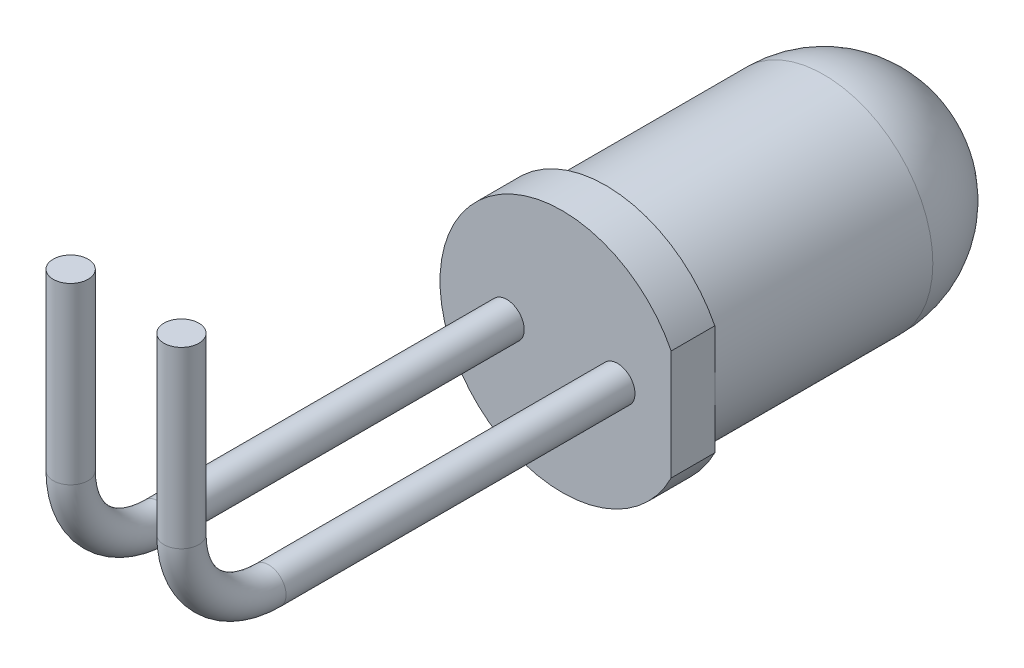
ISO-10303-21;
HEADER;
FILE_DESCRIPTION(('STEP AP214'),'2;1');
FILE_NAME('part.step','',(''),(''),'','','');
FILE_SCHEMA(('AUTOMOTIVE_DESIGN { 1 0 10303 214 1 1 1 1 }'));
ENDSEC;
DATA;
#1=APPLICATION_CONTEXT('core data for automotive mechanical design processes');
#2=APPLICATION_PROTOCOL_DEFINITION('international standard','automotive_design',2000,#1);
#3=PRODUCT_CONTEXT('',#1,'mechanical');
#4=PRODUCT('Part','Part','',(#3));
#5=PRODUCT_RELATED_PRODUCT_CATEGORY('part','',(#4));
#6=PRODUCT_DEFINITION_FORMATION('','',#4);
#7=PRODUCT_DEFINITION_CONTEXT('part definition',#1,'design');
#8=PRODUCT_DEFINITION('design','',#6,#7);
#9=PRODUCT_DEFINITION_SHAPE('','',#8);
#10=(LENGTH_UNIT() NAMED_UNIT(*) SI_UNIT(.MILLI.,.METRE.));
#11=(NAMED_UNIT(*) PLANE_ANGLE_UNIT() SI_UNIT($,.RADIAN.));
#12=(NAMED_UNIT(*) SI_UNIT($,.STERADIAN.) SOLID_ANGLE_UNIT());
#13=UNCERTAINTY_MEASURE_WITH_UNIT(LENGTH_MEASURE(1.E-05),#10,'distance_accuracy_value','');
#14=(GEOMETRIC_REPRESENTATION_CONTEXT(3) GLOBAL_UNCERTAINTY_ASSIGNED_CONTEXT((#13)) GLOBAL_UNIT_ASSIGNED_CONTEXT((#10,
#11,#12)) REPRESENTATION_CONTEXT('',''));
#15=CARTESIAN_POINT('',(0.,0.,0.));
#16=DIRECTION('',(0.,0.,1.));
#17=DIRECTION('',(1.,0.,0.));
#18=AXIS2_PLACEMENT_3D('',#15,#16,#17);
#19=CARTESIAN_POINT('',(0.,0.,8.5));
#20=DIRECTION('',(0.,0.,1.));
#21=DIRECTION('',(1.,0.,0.));
#22=AXIS2_PLACEMENT_3D('',#19,#20,#21);
#23=PLANE('',#22);
#24=CARTESIAN_POINT('',(-1.27,0.,8.5));
#25=DIRECTION('',(0.,0.,1.));
#26=DIRECTION('',(1.,0.,0.));
#27=AXIS2_PLACEMENT_3D('',#24,#25,#26);
#28=CIRCLE('',#27,0.4);
#29=CARTESIAN_POINT('',(-0.87,0.,8.5));
#30=VERTEX_POINT('',#29);
#31=EDGE_CURVE('E11',#30,#30,#28,.T.);
#32=ORIENTED_EDGE('',*,*,#31,.F.);
#33=EDGE_LOOP('',(#32));
#34=FACE_BOUND('',#33,.T.);
#35=DIRECTION('',(0.,1.,0.));
#36=VECTOR('',#35,1.);
#37=CARTESIAN_POINT('',(2.5,1.26095202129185,8.5));
#38=LINE('',#37,#36);
#39=CARTESIAN_POINT('',(2.5,-1.26095202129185,8.5));
#40=VERTEX_POINT('',#39);
#41=CARTESIAN_POINT('',(2.5,1.26095202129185,8.5));
#42=VERTEX_POINT('',#41);
#43=EDGE_CURVE('E79',#40,#42,#38,.T.);
#44=ORIENTED_EDGE('',*,*,#43,.T.);
#45=CARTESIAN_POINT('',(0.,0.,8.5));
#46=DIRECTION('',(0.,0.,1.));
#47=DIRECTION('',(1.,0.,0.));
#48=AXIS2_PLACEMENT_3D('',#45,#46,#47);
#49=CIRCLE('',#48,2.8);
#50=EDGE_CURVE('E69',#42,#40,#49,.T.);
#51=ORIENTED_EDGE('',*,*,#50,.T.);
#52=EDGE_LOOP('',(#44,#51));
#53=FACE_BOUND('',#52,.T.);
#54=CARTESIAN_POINT('',(1.27,0.,8.5));
#55=DIRECTION('',(0.,0.,1.));
#56=DIRECTION('',(1.,0.,0.));
#57=AXIS2_PLACEMENT_3D('',#54,#55,#56);
#58=CIRCLE('',#57,0.4);
#59=CARTESIAN_POINT('',(1.67,0.,8.5));
#60=VERTEX_POINT('',#59);
#61=EDGE_CURVE('E225',#60,#60,#58,.T.);
#62=ORIENTED_EDGE('',*,*,#61,.F.);
#63=EDGE_LOOP('',(#62));
#64=FACE_BOUND('',#63,.T.);
#65=ADVANCED_FACE('F33',(#34,#53,#64),#23,.T.);
#66=CARTESIAN_POINT('',(0.,0.,8.5));
#67=DIRECTION('',(0.,0.,-1.));
#68=DIRECTION('',(-1.,0.,0.));
#69=AXIS2_PLACEMENT_3D('',#66,#67,#68);
#70=CYLINDRICAL_SURFACE('',#69,2.5);
#71=CARTESIAN_POINT('',(0.,0.,2.5));
#72=DIRECTION('',(0.,0.,-1.));
#73=DIRECTION('',(-1.,0.,0.));
#74=AXIS2_PLACEMENT_3D('',#71,#72,#73);
#75=CIRCLE('',#74,2.5);
#76=CARTESIAN_POINT('',(-2.5,0.,2.5));
#77=VERTEX_POINT('',#76);
#78=EDGE_CURVE('E41',#77,#77,#75,.F.);
#79=ORIENTED_EDGE('',*,*,#78,.T.);
#80=EDGE_LOOP('',(#79));
#81=FACE_BOUND('',#80,.T.);
#82=CARTESIAN_POINT('',(0.,0.,7.5));
#83=DIRECTION('',(0.,0.,1.));
#84=DIRECTION('',(1.,0.,0.));
#85=AXIS2_PLACEMENT_3D('',#82,#83,#84);
#86=CIRCLE('',#85,2.5);
#87=CARTESIAN_POINT('',(2.5,0.,7.5));
#88=VERTEX_POINT('',#87);
#89=EDGE_CURVE('E46',#88,#88,#86,.T.);
#90=ORIENTED_EDGE('',*,*,#89,.F.);
#91=EDGE_LOOP('',(#90));
#92=FACE_BOUND('',#91,.T.);
#93=ADVANCED_FACE('F35',(#81,#92),#70,.T.);
#94=CARTESIAN_POINT('',(0.,0.,7.5));
#95=DIRECTION('',(0.,0.,1.));
#96=DIRECTION('',(1.,0.,0.));
#97=AXIS2_PLACEMENT_3D('',#94,#95,#96);
#98=PLANE('',#97);
#99=DIRECTION('',(0.,1.,0.));
#100=VECTOR('',#99,1.);
#101=CARTESIAN_POINT('',(2.5,1.26095202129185,7.5));
#102=LINE('',#101,#100);
#103=CARTESIAN_POINT('',(2.5,1.26095202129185,7.5));
#104=VERTEX_POINT('',#103);
#105=EDGE_CURVE('E53',#88,#104,#102,.T.);
#106=ORIENTED_EDGE('',*,*,#105,.F.);
#107=ORIENTED_EDGE('',*,*,#89,.T.);
#108=CARTESIAN_POINT('',(2.5,-1.26095202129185,7.5));
#109=VERTEX_POINT('',#108);
#110=EDGE_CURVE('E75',#109,#88,#102,.T.);
#111=ORIENTED_EDGE('',*,*,#110,.F.);
#112=CARTESIAN_POINT('',(0.,0.,7.5));
#113=DIRECTION('',(0.,0.,1.));
#114=DIRECTION('',(1.,0.,0.));
#115=AXIS2_PLACEMENT_3D('',#112,#113,#114);
#116=CIRCLE('',#115,2.8);
#117=EDGE_CURVE('E71',#104,#109,#116,.T.);
#118=ORIENTED_EDGE('',*,*,#117,.F.);
#119=EDGE_LOOP('',(#106,#107,#111,#118));
#120=FACE_BOUND('',#119,.T.);
#121=ADVANCED_FACE('F111',(#120),#98,.F.);
#122=CARTESIAN_POINT('',(2.5,1.26095202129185,7.5));
#123=DIRECTION('',(1.,0.,0.));
#124=DIRECTION('',(0.,0.,-1.));
#125=AXIS2_PLACEMENT_3D('',#122,#123,#124);
#126=PLANE('',#125);
#127=ORIENTED_EDGE('',*,*,#110,.T.);
#128=ORIENTED_EDGE('',*,*,#105,.T.);
#129=DIRECTION('',(0.,0.,1.));
#130=VECTOR('',#129,1.);
#131=CARTESIAN_POINT('',(2.5,1.26095202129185,7.5));
#132=LINE('',#131,#130);
#133=EDGE_CURVE('E74',#104,#42,#132,.T.);
#134=ORIENTED_EDGE('',*,*,#133,.T.);
#135=ORIENTED_EDGE('',*,*,#43,.F.);
#136=DIRECTION('',(0.,0.,1.));
#137=VECTOR('',#136,1.);
#138=CARTESIAN_POINT('',(2.5,-1.26095202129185,7.5));
#139=LINE('',#138,#137);
#140=EDGE_CURVE('E66',#109,#40,#139,.T.);
#141=ORIENTED_EDGE('',*,*,#140,.F.);
#142=EDGE_LOOP('',(#127,#128,#134,#135,#141));
#143=FACE_BOUND('',#142,.T.);
#144=ADVANCED_FACE('F82',(#143),#126,.T.);
#145=CARTESIAN_POINT('',(0.,0.,7.5));
#146=DIRECTION('',(0.,0.,1.));
#147=DIRECTION('',(1.,0.,0.));
#148=AXIS2_PLACEMENT_3D('',#145,#146,#147);
#149=CYLINDRICAL_SURFACE('',#148,2.8);
#150=ORIENTED_EDGE('',*,*,#50,.F.);
#151=ORIENTED_EDGE('',*,*,#133,.F.);
#152=ORIENTED_EDGE('',*,*,#117,.T.);
#153=ORIENTED_EDGE('',*,*,#140,.T.);
#154=EDGE_LOOP('',(#150,#151,#152,#153));
#155=FACE_BOUND('',#154,.T.);
#156=ADVANCED_FACE('F68',(#155),#149,.T.);
#157=CARTESIAN_POINT('',(0.,0.,2.5));
#158=DIRECTION('',(0.,0.,1.));
#159=DIRECTION('',(1.,0.,0.));
#160=AXIS2_PLACEMENT_3D('',#157,#158,#159);
#161=SPHERICAL_SURFACE('',#160,2.5);
#162=ORIENTED_EDGE('',*,*,#78,.F.);
#163=EDGE_LOOP('',(#162));
#164=FACE_BOUND('',#163,.T.);
#165=ADVANCED_FACE('F93',(#164),#161,.T.);
#166=CARTESIAN_POINT('',(1.27,2.00000000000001,18.5));
#167=DIRECTION('',(0.,1.,0.));
#168=DIRECTION('',(0.,0.,1.));
#169=AXIS2_PLACEMENT_3D('',#166,#167,#168);
#170=CYLINDRICAL_SURFACE('',#169,0.4);
#171=CARTESIAN_POINT('',(1.27,2.00000000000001,18.5));
#172=DIRECTION('',(0.,1.,0.));
#173=DIRECTION('',(1.,0.,0.));
#174=AXIS2_PLACEMENT_3D('',#171,#172,#173);
#175=CIRCLE('',#174,0.4);
#176=CARTESIAN_POINT('',(1.27,2.00000000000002,18.9));
#177=VERTEX_POINT('',#176);
#178=EDGE_CURVE('E238',#177,#177,#175,.T.);
#179=ORIENTED_EDGE('',*,*,#178,.T.);
#180=EDGE_LOOP('',(#179));
#181=FACE_BOUND('',#180,.T.);
#182=CARTESIAN_POINT('',(1.27,6.,18.5));
#183=DIRECTION('',(0.,1.,0.));
#184=DIRECTION('',(1.,0.,0.));
#185=AXIS2_PLACEMENT_3D('',#182,#183,#184);
#186=CIRCLE('',#185,0.4);
#187=CARTESIAN_POINT('',(1.67,6.,18.5));
#188=VERTEX_POINT('',#187);
#189=EDGE_CURVE('E80',#188,#188,#186,.T.);
#190=ORIENTED_EDGE('',*,*,#189,.F.);
#191=EDGE_LOOP('',(#190));
#192=FACE_BOUND('',#191,.T.);
#193=ADVANCED_FACE('F95',(#181,#192),#170,.T.);
#194=CARTESIAN_POINT('',(1.27,2.,16.5));
#195=DIRECTION('',(-1.,0.,0.));
#196=DIRECTION('',(0.,0.,1.));
#197=AXIS2_PLACEMENT_3D('',#194,#195,#196);
#198=TOROIDAL_SURFACE('',#197,2.,0.4);
#199=CARTESIAN_POINT('',(1.27,0.,16.5));
#200=DIRECTION('',(0.,0.,1.));
#201=DIRECTION('',(1.,0.,0.));
#202=AXIS2_PLACEMENT_3D('',#199,#200,#201);
#203=CIRCLE('',#202,0.4);
#204=CARTESIAN_POINT('',(1.27,-0.4,16.5));
#205=VERTEX_POINT('',#204);
#206=EDGE_CURVE('E229',#205,#205,#203,.T.);
#207=CARTESIAN_POINT('',(1.27,2.,16.5));
#208=DIRECTION('',(-1.,0.,0.));
#209=DIRECTION('',(0.,0.,1.));
#210=AXIS2_PLACEMENT_3D('',#207,#208,#209);
#211=CIRCLE('',#210,2.4);
#212=EDGE_CURVE('',#205,#177,#211,.T.);
#213=ORIENTED_EDGE('',*,*,#206,.T.);
#214=ORIENTED_EDGE('',*,*,#178,.F.);
#215=ORIENTED_EDGE('',*,*,#212,.T.);
#216=ORIENTED_EDGE('',*,*,#212,.F.);
#217=EDGE_LOOP('',(#213,#215,#214,#216));
#218=FACE_BOUND('',#217,.T.);
#219=ADVANCED_FACE('F101',(#218),#198,.T.);
#220=CARTESIAN_POINT('',(1.27,0.,16.5));
#221=DIRECTION('',(0.,0.,-1.));
#222=DIRECTION('',(-1.,0.,0.));
#223=AXIS2_PLACEMENT_3D('',#220,#221,#222);
#224=CYLINDRICAL_SURFACE('',#223,0.4);
#225=ORIENTED_EDGE('',*,*,#206,.F.);
#226=EDGE_LOOP('',(#225));
#227=FACE_BOUND('',#226,.T.);
#228=ORIENTED_EDGE('',*,*,#61,.T.);
#229=EDGE_LOOP('',(#228));
#230=FACE_BOUND('',#229,.T.);
#231=ADVANCED_FACE('F154',(#227,#230),#224,.T.);
#232=CARTESIAN_POINT('',(1.27,6.,18.5));
#233=DIRECTION('',(0.,1.,0.));
#234=DIRECTION('',(1.,0.,0.));
#235=AXIS2_PLACEMENT_3D('',#232,#233,#234);
#236=PLANE('',#235);
#237=ORIENTED_EDGE('',*,*,#189,.T.);
#238=EDGE_LOOP('',(#237));
#239=FACE_BOUND('',#238,.T.);
#240=ADVANCED_FACE('F164',(#239),#236,.T.);
#241=CARTESIAN_POINT('',(-1.27,2.00000000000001,18.5));
#242=DIRECTION('',(0.,1.,0.));
#243=DIRECTION('',(0.,0.,1.));
#244=AXIS2_PLACEMENT_3D('',#241,#242,#243);
#245=CYLINDRICAL_SURFACE('',#244,0.4);
#246=CARTESIAN_POINT('',(-1.27,2.00000000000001,18.5));
#247=DIRECTION('',(0.,-1.,0.));
#248=DIRECTION('',(-1.,0.,0.));
#249=AXIS2_PLACEMENT_3D('',#246,#247,#248);
#250=CIRCLE('',#249,0.4);
#251=CARTESIAN_POINT('',(-1.27,2.00000000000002,18.9));
#252=VERTEX_POINT('',#251);
#253=EDGE_CURVE('E226',#252,#252,#250,.T.);
#254=ORIENTED_EDGE('',*,*,#253,.F.);
#255=EDGE_LOOP('',(#254));
#256=FACE_BOUND('',#255,.T.);
#257=CARTESIAN_POINT('',(-1.27,6.,18.5));
#258=DIRECTION('',(0.,-1.,0.));
#259=DIRECTION('',(-1.,0.,0.));
#260=AXIS2_PLACEMENT_3D('',#257,#258,#259);
#261=CIRCLE('',#260,0.4);
#262=CARTESIAN_POINT('',(-1.67,6.,18.5));
#263=VERTEX_POINT('',#262);
#264=EDGE_CURVE('E223',#263,#263,#261,.T.);
#265=ORIENTED_EDGE('',*,*,#264,.T.);
#266=EDGE_LOOP('',(#265));
#267=FACE_BOUND('',#266,.T.);
#268=ADVANCED_FACE('F173',(#256,#267),#245,.T.);
#269=CARTESIAN_POINT('',(-1.27,2.,16.5));
#270=DIRECTION('',(-1.,0.,0.));
#271=DIRECTION('',(0.,0.,1.));
#272=AXIS2_PLACEMENT_3D('',#269,#270,#271);
#273=TOROIDAL_SURFACE('',#272,2.,0.4);
#274=CARTESIAN_POINT('',(-1.27,0.,16.5));
#275=DIRECTION('',(0.,0.,-1.));
#276=DIRECTION('',(-1.,0.,0.));
#277=AXIS2_PLACEMENT_3D('',#274,#275,#276);
#278=CIRCLE('',#277,0.4);
#279=CARTESIAN_POINT('',(-1.27,-0.4,16.5));
#280=VERTEX_POINT('',#279);
#281=EDGE_CURVE('E232',#280,#280,#278,.T.);
#282=CARTESIAN_POINT('',(-1.27,2.,16.5));
#283=DIRECTION('',(-1.,0.,0.));
#284=DIRECTION('',(0.,0.,1.));
#285=AXIS2_PLACEMENT_3D('',#282,#283,#284);
#286=CIRCLE('',#285,2.4);
#287=EDGE_CURVE('',#280,#252,#286,.T.);
#288=ORIENTED_EDGE('',*,*,#281,.F.);
#289=ORIENTED_EDGE('',*,*,#253,.T.);
#290=ORIENTED_EDGE('',*,*,#287,.T.);
#291=ORIENTED_EDGE('',*,*,#287,.F.);
#292=EDGE_LOOP('',(#288,#290,#289,#291));
#293=FACE_BOUND('',#292,.T.);
#294=ADVANCED_FACE('F187',(#293),#273,.T.);
#295=CARTESIAN_POINT('',(-1.27,0.,16.5));
#296=DIRECTION('',(0.,0.,-1.));
#297=DIRECTION('',(-1.,0.,0.));
#298=AXIS2_PLACEMENT_3D('',#295,#296,#297);
#299=CYLINDRICAL_SURFACE('',#298,0.4);
#300=ORIENTED_EDGE('',*,*,#281,.T.);
#301=EDGE_LOOP('',(#300));
#302=FACE_BOUND('',#301,.T.);
#303=ORIENTED_EDGE('',*,*,#31,.T.);
#304=EDGE_LOOP('',(#303));
#305=FACE_BOUND('',#304,.T.);
#306=ADVANCED_FACE('F197',(#302,#305),#299,.T.);
#307=CARTESIAN_POINT('',(-1.27,6.,18.5));
#308=DIRECTION('',(0.,1.,0.));
#309=DIRECTION('',(-1.,0.,0.));
#310=AXIS2_PLACEMENT_3D('',#307,#308,#309);
#311=PLANE('',#310);
#312=ORIENTED_EDGE('',*,*,#264,.F.);
#313=EDGE_LOOP('',(#312));
#314=FACE_BOUND('',#313,.T.);
#315=ADVANCED_FACE('F207',(#314),#311,.T.);
#316=CLOSED_SHELL('',(#65,#93,#121,#144,#156,#165,#193,#219,#231,#240,#268,#294,#306,#315));
#317=MANIFOLD_SOLID_BREP('B2',#316);
#318=ADVANCED_BREP_SHAPE_REPRESENTATION('',(#18,#317),#14);
#319=SHAPE_DEFINITION_REPRESENTATION(#9,#318);
ENDSEC;
END-ISO-10303-21;
